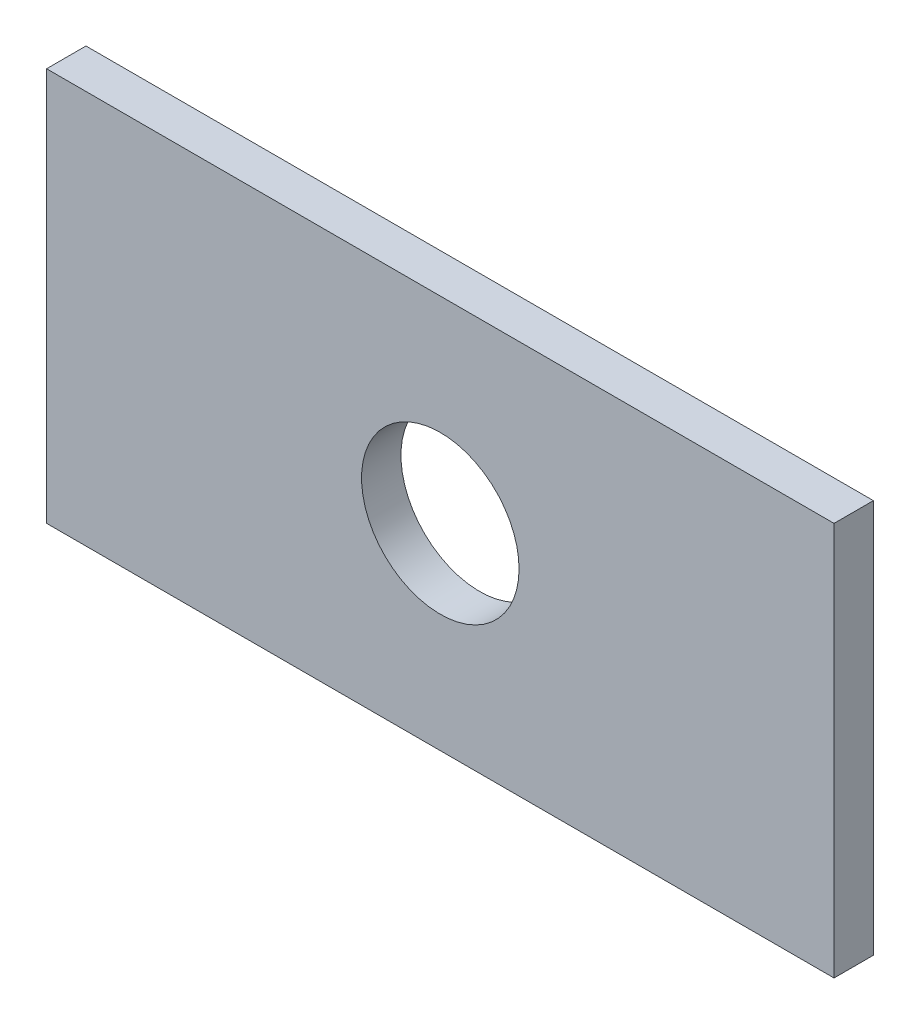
ISO-10303-21;
HEADER;
FILE_DESCRIPTION(('STEP AP214'),'2;1');
FILE_NAME('part.step','',(''),(''),'','','');
FILE_SCHEMA(('AUTOMOTIVE_DESIGN { 1 0 10303 214 1 1 1 1 }'));
ENDSEC;
DATA;
#1=APPLICATION_CONTEXT('core data for automotive mechanical design processes');
#2=APPLICATION_PROTOCOL_DEFINITION('international standard','automotive_design',2000,#1);
#3=PRODUCT_CONTEXT('',#1,'mechanical');
#4=PRODUCT('Part','Part','',(#3));
#5=PRODUCT_RELATED_PRODUCT_CATEGORY('part','',(#4));
#6=PRODUCT_DEFINITION_FORMATION('','',#4);
#7=PRODUCT_DEFINITION_CONTEXT('part definition',#1,'design');
#8=PRODUCT_DEFINITION('design','',#6,#7);
#9=PRODUCT_DEFINITION_SHAPE('','',#8);
#10=(LENGTH_UNIT() NAMED_UNIT(*) SI_UNIT(.MILLI.,.METRE.));
#11=(NAMED_UNIT(*) PLANE_ANGLE_UNIT() SI_UNIT($,.RADIAN.));
#12=(NAMED_UNIT(*) SI_UNIT($,.STERADIAN.) SOLID_ANGLE_UNIT());
#13=UNCERTAINTY_MEASURE_WITH_UNIT(LENGTH_MEASURE(1.E-05),#10,'distance_accuracy_value','');
#14=(GEOMETRIC_REPRESENTATION_CONTEXT(3) GLOBAL_UNCERTAINTY_ASSIGNED_CONTEXT((#13)) GLOBAL_UNIT_ASSIGNED_CONTEXT((#10,
#11,#12)) REPRESENTATION_CONTEXT('',''));
#15=CARTESIAN_POINT('',(0.,0.,0.));
#16=DIRECTION('',(0.,0.,1.));
#17=DIRECTION('',(1.,0.,0.));
#18=AXIS2_PLACEMENT_3D('',#15,#16,#17);
#19=CARTESIAN_POINT('',(-100.,-50.,10.));
#20=DIRECTION('',(0.,1.,0.));
#21=DIRECTION('',(0.,0.,1.));
#22=AXIS2_PLACEMENT_3D('',#19,#20,#21);
#23=PLANE('',#22);
#24=DIRECTION('',(1.,0.,0.));
#25=VECTOR('',#24,1.);
#26=CARTESIAN_POINT('',(-100.,-50.,0.));
#27=LINE('',#26,#25);
#28=CARTESIAN_POINT('',(-100.,-50.,0.));
#29=VERTEX_POINT('',#28);
#30=CARTESIAN_POINT('',(100.,-50.,0.));
#31=VERTEX_POINT('',#30);
#32=EDGE_CURVE('E99',#29,#31,#27,.T.);
#33=ORIENTED_EDGE('',*,*,#32,.T.);
#34=DIRECTION('',(0.,0.,-1.));
#35=VECTOR('',#34,1.);
#36=CARTESIAN_POINT('',(100.,-50.,10.));
#37=LINE('',#36,#35);
#38=CARTESIAN_POINT('',(100.,-50.,10.));
#39=VERTEX_POINT('',#38);
#40=EDGE_CURVE('E11',#39,#31,#37,.T.);
#41=ORIENTED_EDGE('',*,*,#40,.F.);
#42=DIRECTION('',(1.,0.,0.));
#43=VECTOR('',#42,1.);
#44=CARTESIAN_POINT('',(-100.,-50.,10.));
#45=LINE('',#44,#43);
#46=CARTESIAN_POINT('',(-100.,-50.,10.));
#47=VERTEX_POINT('',#46);
#48=EDGE_CURVE('E87',#47,#39,#45,.T.);
#49=ORIENTED_EDGE('',*,*,#48,.F.);
#50=DIRECTION('',(0.,0.,-1.));
#51=VECTOR('',#50,1.);
#52=CARTESIAN_POINT('',(-100.,-50.,10.));
#53=LINE('',#52,#51);
#54=EDGE_CURVE('E95',#47,#29,#53,.T.);
#55=ORIENTED_EDGE('',*,*,#54,.T.);
#56=EDGE_LOOP('',(#33,#41,#49,#55));
#57=FACE_BOUND('',#56,.T.);
#58=ADVANCED_FACE('F36',(#57),#23,.F.);
#59=CARTESIAN_POINT('',(100.,-50.,10.));
#60=DIRECTION('',(-1.,0.,0.));
#61=DIRECTION('',(0.,0.,1.));
#62=AXIS2_PLACEMENT_3D('',#59,#60,#61);
#63=PLANE('',#62);
#64=DIRECTION('',(0.,1.,0.));
#65=VECTOR('',#64,1.);
#66=CARTESIAN_POINT('',(100.,-50.,0.));
#67=LINE('',#66,#65);
#68=CARTESIAN_POINT('',(100.,50.,0.));
#69=VERTEX_POINT('',#68);
#70=EDGE_CURVE('E91',#31,#69,#67,.T.);
#71=ORIENTED_EDGE('',*,*,#70,.T.);
#72=DIRECTION('',(0.,0.,-1.));
#73=VECTOR('',#72,1.);
#74=CARTESIAN_POINT('',(100.,50.,10.));
#75=LINE('',#74,#73);
#76=CARTESIAN_POINT('',(100.,50.,10.));
#77=VERTEX_POINT('',#76);
#78=EDGE_CURVE('E44',#77,#69,#75,.T.);
#79=ORIENTED_EDGE('',*,*,#78,.F.);
#80=DIRECTION('',(0.,1.,0.));
#81=VECTOR('',#80,1.);
#82=CARTESIAN_POINT('',(100.,-50.,10.));
#83=LINE('',#82,#81);
#84=EDGE_CURVE('E82',#39,#77,#83,.T.);
#85=ORIENTED_EDGE('',*,*,#84,.F.);
#86=ORIENTED_EDGE('',*,*,#40,.T.);
#87=EDGE_LOOP('',(#71,#79,#85,#86));
#88=FACE_BOUND('',#87,.T.);
#89=ADVANCED_FACE('F90',(#88),#63,.F.);
#90=CARTESIAN_POINT('',(-100.,50.,10.));
#91=DIRECTION('',(0.,-1.,0.));
#92=DIRECTION('',(1.,0.,0.));
#93=AXIS2_PLACEMENT_3D('',#90,#91,#92);
#94=PLANE('',#93);
#95=DIRECTION('',(-1.,0.,0.));
#96=VECTOR('',#95,1.);
#97=CARTESIAN_POINT('',(-100.,50.,0.));
#98=LINE('',#97,#96);
#99=CARTESIAN_POINT('',(-100.,50.,0.));
#100=VERTEX_POINT('',#99);
#101=EDGE_CURVE('E69',#69,#100,#98,.T.);
#102=ORIENTED_EDGE('',*,*,#101,.T.);
#103=DIRECTION('',(0.,0.,-1.));
#104=VECTOR('',#103,1.);
#105=CARTESIAN_POINT('',(-100.,50.,10.));
#106=LINE('',#105,#104);
#107=CARTESIAN_POINT('',(-100.,50.,10.));
#108=VERTEX_POINT('',#107);
#109=EDGE_CURVE('E92',#108,#100,#106,.T.);
#110=ORIENTED_EDGE('',*,*,#109,.F.);
#111=DIRECTION('',(-1.,0.,0.));
#112=VECTOR('',#111,1.);
#113=CARTESIAN_POINT('',(-100.,50.,10.));
#114=LINE('',#113,#112);
#115=EDGE_CURVE('E85',#77,#108,#114,.T.);
#116=ORIENTED_EDGE('',*,*,#115,.F.);
#117=ORIENTED_EDGE('',*,*,#78,.T.);
#118=EDGE_LOOP('',(#102,#110,#116,#117));
#119=FACE_BOUND('',#118,.T.);
#120=ADVANCED_FACE('F93',(#119),#94,.F.);
#121=CARTESIAN_POINT('',(-100.,-50.,10.));
#122=DIRECTION('',(1.,0.,0.));
#123=DIRECTION('',(0.,0.,-1.));
#124=AXIS2_PLACEMENT_3D('',#121,#122,#123);
#125=PLANE('',#124);
#126=DIRECTION('',(0.,-1.,0.));
#127=VECTOR('',#126,1.);
#128=CARTESIAN_POINT('',(-100.,-50.,0.));
#129=LINE('',#128,#127);
#130=EDGE_CURVE('E75',#100,#29,#129,.T.);
#131=ORIENTED_EDGE('',*,*,#130,.T.);
#132=ORIENTED_EDGE('',*,*,#54,.F.);
#133=DIRECTION('',(0.,-1.,0.));
#134=VECTOR('',#133,1.);
#135=CARTESIAN_POINT('',(-100.,-50.,10.));
#136=LINE('',#135,#134);
#137=EDGE_CURVE('E52',#108,#47,#136,.T.);
#138=ORIENTED_EDGE('',*,*,#137,.F.);
#139=ORIENTED_EDGE('',*,*,#109,.T.);
#140=EDGE_LOOP('',(#131,#132,#138,#139));
#141=FACE_BOUND('',#140,.T.);
#142=ADVANCED_FACE('F107',(#141),#125,.F.);
#143=CARTESIAN_POINT('',(100.,-50.,10.));
#144=DIRECTION('',(0.,0.,1.));
#145=DIRECTION('',(1.,0.,0.));
#146=AXIS2_PLACEMENT_3D('',#143,#144,#145);
#147=PLANE('',#146);
#148=CARTESIAN_POINT('',(0.,0.,10.));
#149=DIRECTION('',(0.,0.,1.));
#150=DIRECTION('',(1.,0.,0.));
#151=AXIS2_PLACEMENT_3D('',#148,#149,#150);
#152=CIRCLE('',#151,20.);
#153=CARTESIAN_POINT('',(20.,0.,10.));
#154=VERTEX_POINT('',#153);
#155=EDGE_CURVE('E113',#154,#154,#152,.T.);
#156=ORIENTED_EDGE('',*,*,#155,.F.);
#157=EDGE_LOOP('',(#156));
#158=FACE_BOUND('',#157,.T.);
#159=ORIENTED_EDGE('',*,*,#48,.T.);
#160=ORIENTED_EDGE('',*,*,#84,.T.);
#161=ORIENTED_EDGE('',*,*,#115,.T.);
#162=ORIENTED_EDGE('',*,*,#137,.T.);
#163=EDGE_LOOP('',(#159,#160,#161,#162));
#164=FACE_BOUND('',#163,.T.);
#165=ADVANCED_FACE('F83',(#158,#164),#147,.T.);
#166=CARTESIAN_POINT('',(100.,-50.,0.));
#167=DIRECTION('',(0.,0.,1.));
#168=DIRECTION('',(1.,0.,0.));
#169=AXIS2_PLACEMENT_3D('',#166,#167,#168);
#170=PLANE('',#169);
#171=CARTESIAN_POINT('',(0.,0.,0.));
#172=DIRECTION('',(0.,0.,1.));
#173=DIRECTION('',(1.,0.,0.));
#174=AXIS2_PLACEMENT_3D('',#171,#172,#173);
#175=CIRCLE('',#174,20.);
#176=CARTESIAN_POINT('',(20.,0.,0.));
#177=VERTEX_POINT('',#176);
#178=EDGE_CURVE('E102',#177,#177,#175,.T.);
#179=ORIENTED_EDGE('',*,*,#178,.T.);
#180=EDGE_LOOP('',(#179));
#181=FACE_BOUND('',#180,.T.);
#182=ORIENTED_EDGE('',*,*,#32,.F.);
#183=ORIENTED_EDGE('',*,*,#130,.F.);
#184=ORIENTED_EDGE('',*,*,#101,.F.);
#185=ORIENTED_EDGE('',*,*,#70,.F.);
#186=EDGE_LOOP('',(#182,#183,#184,#185));
#187=FACE_BOUND('',#186,.T.);
#188=ADVANCED_FACE('F110',(#181,#187),#170,.F.);
#189=CARTESIAN_POINT('',(0.,0.,0.));
#190=DIRECTION('',(0.,0.,1.));
#191=DIRECTION('',(1.,0.,0.));
#192=AXIS2_PLACEMENT_3D('',#189,#190,#191);
#193=CYLINDRICAL_SURFACE('',#192,20.);
#194=ORIENTED_EDGE('',*,*,#178,.F.);
#195=EDGE_LOOP('',(#194));
#196=FACE_BOUND('',#195,.T.);
#197=ORIENTED_EDGE('',*,*,#155,.T.);
#198=EDGE_LOOP('',(#197));
#199=FACE_BOUND('',#198,.T.);
#200=ADVANCED_FACE('F120',(#196,#199),#193,.F.);
#201=CLOSED_SHELL('',(#58,#89,#120,#142,#165,#188,#200));
#202=MANIFOLD_SOLID_BREP('B2',#201);
#203=ADVANCED_BREP_SHAPE_REPRESENTATION('',(#18,#202),#14);
#204=SHAPE_DEFINITION_REPRESENTATION(#9,#203);
ENDSEC;
END-ISO-10303-21;
